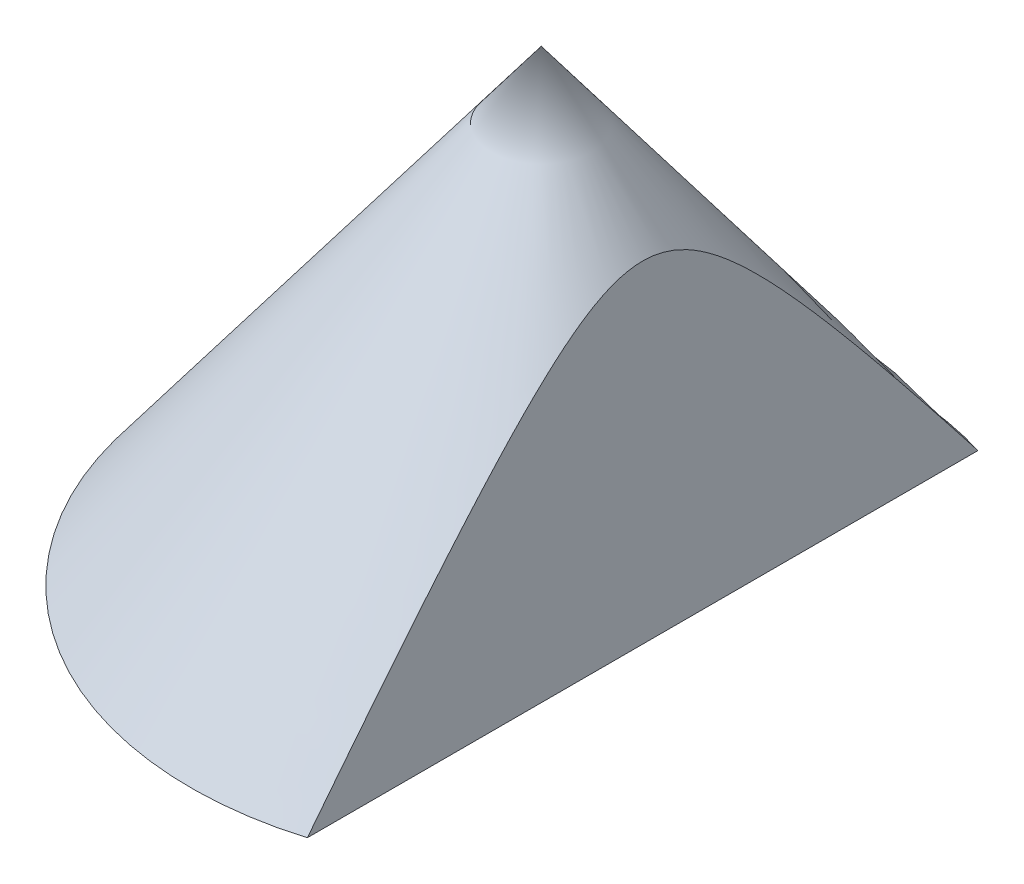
ISO-10303-21;
HEADER;
FILE_DESCRIPTION(('STEP AP214'),'2;1');
FILE_NAME('part.step','',(''),(''),'','','');
FILE_SCHEMA(('AUTOMOTIVE_DESIGN { 1 0 10303 214 1 1 1 1 }'));
ENDSEC;
DATA;
#1=APPLICATION_CONTEXT('core data for automotive mechanical design processes');
#2=APPLICATION_PROTOCOL_DEFINITION('international standard','automotive_design',2000,#1);
#3=PRODUCT_CONTEXT('',#1,'mechanical');
#4=PRODUCT('Part','Part','',(#3));
#5=PRODUCT_RELATED_PRODUCT_CATEGORY('part','',(#4));
#6=PRODUCT_DEFINITION_FORMATION('','',#4);
#7=PRODUCT_DEFINITION_CONTEXT('part definition',#1,'design');
#8=PRODUCT_DEFINITION('design','',#6,#7);
#9=PRODUCT_DEFINITION_SHAPE('','',#8);
#10=(LENGTH_UNIT() NAMED_UNIT(*) SI_UNIT(.MILLI.,.METRE.));
#11=(NAMED_UNIT(*) PLANE_ANGLE_UNIT() SI_UNIT($,.RADIAN.));
#12=(NAMED_UNIT(*) SI_UNIT($,.STERADIAN.) SOLID_ANGLE_UNIT());
#13=UNCERTAINTY_MEASURE_WITH_UNIT(LENGTH_MEASURE(1.E-05),#10,'distance_accuracy_value','');
#14=(GEOMETRIC_REPRESENTATION_CONTEXT(3) GLOBAL_UNCERTAINTY_ASSIGNED_CONTEXT((#13)) GLOBAL_UNIT_ASSIGNED_CONTEXT((#10,
#11,#12)) REPRESENTATION_CONTEXT('',''));
#15=CARTESIAN_POINT('',(0.,0.,0.));
#16=DIRECTION('',(0.,0.,1.));
#17=DIRECTION('',(1.,0.,0.));
#18=AXIS2_PLACEMENT_3D('',#15,#16,#17);
#19=CARTESIAN_POINT('',(0.,12.9310344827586,0.));
#20=DIRECTION('',(0.,-1.,0.));
#21=DIRECTION('',(0.,0.,-1.));
#22=AXIS2_PLACEMENT_3D('',#19,#20,#21);
#23=PLANE('',#22);
#24=DIRECTION('',(0.,0.,1.));
#25=VECTOR('',#24,1.);
#26=CARTESIAN_POINT('',(17.3714648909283,12.9310344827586,-60.));
#27=LINE('',#26,#25);
#28=CARTESIAN_POINT('',(17.3714648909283,12.9310344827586,-57.430237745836));
#29=VERTEX_POINT('',#28);
#30=CARTESIAN_POINT('',(17.3714648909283,12.9310344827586,57.430237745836));
#31=VERTEX_POINT('',#30);
#32=EDGE_CURVE('E70',#29,#31,#27,.T.);
#33=ORIENTED_EDGE('',*,*,#32,.T.);
#34=CARTESIAN_POINT('',(0.,12.9310344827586,0.));
#35=DIRECTION('',(0.,-1.,0.));
#36=DIRECTION('',(0.,0.,-1.));
#37=AXIS2_PLACEMENT_3D('',#34,#35,#36);
#38=CIRCLE('',#37,60.);
#39=EDGE_CURVE('E56',#31,#29,#38,.T.);
#40=ORIENTED_EDGE('',*,*,#39,.T.);
#41=EDGE_LOOP('',(#33,#40));
#42=FACE_BOUND('',#41,.T.);
#43=ADVANCED_FACE('F43',(#42),#23,.T.);
#44=CARTESIAN_POINT('',(0.,12.9310344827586,0.));
#45=DIRECTION('',(0.,-1.,0.));
#46=DIRECTION('',(0.,0.,-1.));
#47=AXIS2_PLACEMENT_3D('',#44,#45,#46);
#48=CONICAL_SURFACE('',#47,60.,0.643501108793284);
#49=CARTESIAN_POINT('',(17.3714648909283,-119.84929793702,-158.636956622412));
#50=CARTESIAN_POINT('',(17.3714648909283,-116.626973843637,-156.205759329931));
#51=CARTESIAN_POINT('',(17.3714648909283,-113.404961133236,-153.774149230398));
#52=CARTESIAN_POINT('',(17.3714648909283,-106.961670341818,-148.909955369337));
#53=CARTESIAN_POINT('',(17.3714648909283,-103.740392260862,-146.477371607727));
#54=CARTESIAN_POINT('',(17.3714648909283,-97.2986116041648,-141.611028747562));
#55=CARTESIAN_POINT('',(17.3714648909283,-94.0781090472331,-139.177269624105));
#56=CARTESIAN_POINT('',(17.3714648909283,-87.6380948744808,-134.308440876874));
#57=CARTESIAN_POINT('',(17.3714648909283,-84.4185832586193,-131.873371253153));
#58=CARTESIAN_POINT('',(17.3714648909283,-77.9775812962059,-126.999309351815));
#59=CARTESIAN_POINT('',(17.3714648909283,-74.7560920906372,-124.56031556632));
#60=CARTESIAN_POINT('',(17.3714648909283,-68.314504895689,-119.680491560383));
#61=CARTESIAN_POINT('',(17.3714648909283,-65.0944069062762,-117.239661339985));
#62=CARTESIAN_POINT('',(17.3714648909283,-58.6559505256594,-112.355846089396));
#63=CARTESIAN_POINT('',(17.3714648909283,-55.437592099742,-109.912861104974));
#64=CARTESIAN_POINT('',(17.3714648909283,-49.0029127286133,-105.024211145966));
#65=CARTESIAN_POINT('',(17.3714648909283,-45.7865917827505,-102.578546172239));
#66=CARTESIAN_POINT('',(17.3714648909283,-39.1696396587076,-97.5417048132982));
#67=CARTESIAN_POINT('',(17.3714648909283,-35.7691587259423,-94.9503310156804));
#68=CARTESIAN_POINT('',(17.3714648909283,-28.9717723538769,-89.7628984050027));
#69=CARTESIAN_POINT('',(17.3714648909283,-25.5748669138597,-87.1668395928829));
#70=CARTESIAN_POINT('',(17.3714648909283,-18.7854778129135,-81.9684796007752));
#71=CARTESIAN_POINT('',(17.3714648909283,-15.3929944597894,-79.366178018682));
#72=CARTESIAN_POINT('',(17.3714648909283,-8.61421933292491,-74.1535487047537));
#73=CARTESIAN_POINT('',(17.3714648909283,-5.22792753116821,-71.5432210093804));
#74=CARTESIAN_POINT('',(17.3714648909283,-0.156104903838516,-67.6203896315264));
#75=CARTESIAN_POINT('',(17.3714648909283,1.53262868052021,-66.3120267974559));
#76=CARTESIAN_POINT('',(17.3714648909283,4.90754408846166,-63.6920146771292));
#77=CARTESIAN_POINT('',(17.3714648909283,6.59372591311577,-62.3803653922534));
#78=CARTESIAN_POINT('',(17.3714648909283,9.96305894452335,-59.7531103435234));
#79=CARTESIAN_POINT('',(17.3714648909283,11.646210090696,-58.437504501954));
#80=CARTESIAN_POINT('',(17.3714648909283,15.0087779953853,-55.8015301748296));
#81=CARTESIAN_POINT('',(17.3714648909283,16.6881947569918,-54.4811616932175));
#82=CARTESIAN_POINT('',(17.3714648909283,20.042222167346,-51.8347320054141));
#83=CARTESIAN_POINT('',(17.3714648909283,21.7168333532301,-50.5086714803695));
#84=CARTESIAN_POINT('',(17.3714648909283,25.0602681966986,-47.8492573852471));
#85=CARTESIAN_POINT('',(17.3714648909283,26.7290918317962,-46.5159037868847));
#86=CARTESIAN_POINT('',(17.3714648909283,30.0592713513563,-43.8400087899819));
#87=CARTESIAN_POINT('',(17.3714648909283,31.7206274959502,-42.4974677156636));
#88=CARTESIAN_POINT('',(17.3714648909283,34.2053333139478,-40.474668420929));
#89=CARTESIAN_POINT('',(17.3714648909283,35.032344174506,-39.7989065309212));
#90=CARTESIAN_POINT('',(17.3714648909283,36.6835274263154,-38.4439248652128));
#91=CARTESIAN_POINT('',(17.3714648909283,37.5076998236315,-37.7647050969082));
#92=CARTESIAN_POINT('',(17.3714648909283,38.860030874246,-36.6446872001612));
#93=CARTESIAN_POINT('',(17.3714648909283,39.389158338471,-36.2050586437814));
#94=CARTESIAN_POINT('',(17.3714648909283,40.4458870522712,-35.3239690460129));
#95=CARTESIAN_POINT('',(17.3714648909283,40.9734882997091,-34.8825080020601));
#96=CARTESIAN_POINT('',(17.3714648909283,42.0270005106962,-33.9975523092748));
#97=CARTESIAN_POINT('',(17.3714648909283,42.5529114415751,-33.5540576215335));
#98=CARTESIAN_POINT('',(17.3714648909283,43.6028270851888,-32.6648182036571));
#99=CARTESIAN_POINT('',(17.3714648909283,44.1268317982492,-32.2190734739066));
#100=CARTESIAN_POINT('',(17.3714648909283,45.6965104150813,-30.8773508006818));
#101=CARTESIAN_POINT('',(17.3714648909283,46.7389781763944,-29.9776142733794));
#102=CARTESIAN_POINT('',(17.3714648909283,48.812939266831,-28.1656207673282));
#103=CARTESIAN_POINT('',(17.3714648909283,49.8444329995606,-27.2533642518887));
#104=CARTESIAN_POINT('',(17.3714648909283,51.3777363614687,-25.8756806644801));
#105=CARTESIAN_POINT('',(17.3714648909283,51.8849929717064,-25.4163139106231));
#106=CARTESIAN_POINT('',(17.3714648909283,52.8953462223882,-24.4930310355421));
#107=CARTESIAN_POINT('',(17.3714648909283,53.3984428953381,-24.0291149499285));
#108=CARTESIAN_POINT('',(17.3714648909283,54.3998747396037,-23.0959876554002));
#109=CARTESIAN_POINT('',(17.3714648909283,54.898209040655,-22.6267755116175));
#110=CARTESIAN_POINT('',(17.3714648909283,55.8891522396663,-21.6823424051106));
#111=CARTESIAN_POINT('',(17.3714648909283,56.3817611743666,-21.2071214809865));
#112=CARTESIAN_POINT('',(17.3714648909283,57.359552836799,-20.250304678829));
#113=CARTESIAN_POINT('',(17.3714648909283,57.844744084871,-19.7687175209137));
#114=CARTESIAN_POINT('',(17.3714648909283,58.8069593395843,-18.7974055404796));
#115=CARTESIAN_POINT('',(17.3714648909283,59.2839830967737,-18.3076804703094));
#116=CARTESIAN_POINT('',(17.3714648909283,60.2278915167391,-17.3188509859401));
#117=CARTESIAN_POINT('',(17.3714648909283,60.6947795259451,-16.8197497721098));
#118=CARTESIAN_POINT('',(17.3714648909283,61.6162051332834,-15.8103016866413));
#119=CARTESIAN_POINT('',(17.3714648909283,62.0707438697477,-15.2999558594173));
#120=CARTESIAN_POINT('',(17.3714648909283,62.7324496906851,-14.5341796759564));
#121=CARTESIAN_POINT('',(17.3714648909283,62.945583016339,-14.2838966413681));
#122=CARTESIAN_POINT('',(17.3714648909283,63.3678121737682,-13.7799393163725));
#123=CARTESIAN_POINT('',(17.3714648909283,63.5769079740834,-13.5262649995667));
#124=CARTESIAN_POINT('',(17.3714648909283,63.9905886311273,-13.0151834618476));
#125=CARTESIAN_POINT('',(17.3714648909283,64.1951726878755,-12.7577755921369));
#126=CARTESIAN_POINT('',(17.3714648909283,64.5991806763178,-12.2389476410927));
#127=CARTESIAN_POINT('',(17.3714648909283,64.7986046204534,-11.9775275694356));
#128=CARTESIAN_POINT('',(17.3714648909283,65.3882628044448,-11.1865420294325));
#129=CARTESIAN_POINT('',(17.3714648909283,65.7697655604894,-10.6503955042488));
#130=CARTESIAN_POINT('',(17.3714648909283,66.5023201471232,-9.55764440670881));
#131=CARTESIAN_POINT('',(17.3714648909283,66.8533790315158,-9.0010446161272));
#132=CARTESIAN_POINT('',(17.3714648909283,67.4316320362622,-8.00789999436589));
#133=CARTESIAN_POINT('',(17.3714648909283,67.6677119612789,-7.57655165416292));
#134=CARTESIAN_POINT('',(17.3714648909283,68.1121122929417,-6.69961379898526));
#135=CARTESIAN_POINT('',(17.3714648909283,68.3204312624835,-6.25402354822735));
#136=CARTESIAN_POINT('',(17.3714648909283,68.7024948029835,-5.34936555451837));
#137=CARTESIAN_POINT('',(17.3714648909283,68.8763208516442,-4.89033258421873));
#138=CARTESIAN_POINT('',(17.3714648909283,69.1828836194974,-3.95869975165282));
#139=CARTESIAN_POINT('',(17.3714648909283,69.3156364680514,-3.48610529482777));
#140=CARTESIAN_POINT('',(17.3714648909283,69.5089446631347,-2.63641343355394));
#141=CARTESIAN_POINT('',(17.3714648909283,69.5789930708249,-2.26147493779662));
#142=CARTESIAN_POINT('',(17.3714648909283,69.6874574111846,-1.50703139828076));
#143=CARTESIAN_POINT('',(17.3714648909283,69.725877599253,-1.1275269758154));
#144=CARTESIAN_POINT('',(17.3714648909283,69.7694552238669,-0.366822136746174));
#145=CARTESIAN_POINT('',(17.3714648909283,69.7746324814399,0.0143771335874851));
#146=CARTESIAN_POINT('',(17.3714648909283,69.7515516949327,0.775767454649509));
#147=CARTESIAN_POINT('',(17.3714648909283,69.7232922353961,1.15595846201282));
#148=CARTESIAN_POINT('',(17.3714648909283,69.6347197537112,1.9110753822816));
#149=CARTESIAN_POINT('',(17.3714648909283,69.5745291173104,2.2860158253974));
#150=CARTESIAN_POINT('',(17.3714648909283,69.4245281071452,3.02986902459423));
#151=CARTESIAN_POINT('',(17.3714648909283,69.3347170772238,3.39878164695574));
#152=CARTESIAN_POINT('',(17.3714648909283,69.1284406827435,4.1293835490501));
#153=CARTESIAN_POINT('',(17.3714648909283,69.0119501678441,4.49106566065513));
#154=CARTESIAN_POINT('',(17.3714648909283,68.7556718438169,5.20604645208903));
#155=CARTESIAN_POINT('',(17.3714648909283,68.6158820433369,5.55934441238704));
#156=CARTESIAN_POINT('',(17.3714648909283,68.3194332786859,6.24983383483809));
#157=CARTESIAN_POINT('',(17.3714648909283,68.1631969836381,6.58720807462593));
#158=CARTESIAN_POINT('',(17.3714648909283,67.8342436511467,7.25383530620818));
#159=CARTESIAN_POINT('',(17.3714648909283,67.6615244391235,7.58308721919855));
#160=CARTESIAN_POINT('',(17.3714648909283,67.3018783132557,8.23408952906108));
#161=CARTESIAN_POINT('',(17.3714648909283,67.1149387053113,8.55583288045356));
#162=CARTESIAN_POINT('',(17.3714648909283,66.7290807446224,9.19198135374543));
#163=CARTESIAN_POINT('',(17.3714648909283,66.5301636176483,9.50638722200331));
#164=CARTESIAN_POINT('',(17.3714648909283,66.1210809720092,10.1299753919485));
#165=CARTESIAN_POINT('',(17.3714648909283,65.910865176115,10.4391246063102));
#166=CARTESIAN_POINT('',(17.3714648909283,65.481561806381,11.0511906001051));
#167=CARTESIAN_POINT('',(17.3714648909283,65.2624740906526,11.3541072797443));
#168=CARTESIAN_POINT('',(17.3714648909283,64.8167914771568,11.9540882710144));
#169=CARTESIAN_POINT('',(17.3714648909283,64.5902008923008,12.2511557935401));
#170=CARTESIAN_POINT('',(17.3714648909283,64.1304333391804,12.840119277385));
#171=CARTESIAN_POINT('',(17.3714648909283,63.8972566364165,13.1320154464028));
#172=CARTESIAN_POINT('',(17.3714648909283,63.3798299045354,13.7667460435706));
#173=CARTESIAN_POINT('',(17.3714648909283,63.0943725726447,14.1085954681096));
#174=CARTESIAN_POINT('',(17.3714648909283,62.5165068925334,14.7863800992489));
#175=CARTESIAN_POINT('',(17.3714648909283,62.2240982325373,15.1223150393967));
#176=CARTESIAN_POINT('',(17.3714648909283,61.6332669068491,15.7889601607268));
#177=CARTESIAN_POINT('',(17.3714648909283,61.3348431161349,16.1196693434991));
#178=CARTESIAN_POINT('',(17.3714648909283,60.7328341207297,16.7763610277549));
#179=CARTESIAN_POINT('',(17.3714648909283,60.4292487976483,17.102343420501));
#180=CARTESIAN_POINT('',(17.3714648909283,59.5112980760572,18.0744710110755));
#181=CARTESIAN_POINT('',(17.3714648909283,58.8902071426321,18.714271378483));
#182=CARTESIAN_POINT('',(17.3714648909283,57.6343408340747,19.9801142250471));
#183=CARTESIAN_POINT('',(17.3714648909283,56.9995666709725,20.6061579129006));
#184=CARTESIAN_POINT('',(17.3714648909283,55.7173675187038,21.8487873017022));
#185=CARTESIAN_POINT('',(17.3714648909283,55.0699118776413,22.4653413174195));
#186=CARTESIAN_POINT('',(17.3714648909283,53.766252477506,23.6891351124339));
#187=CARTESIAN_POINT('',(17.3714648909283,53.1100485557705,24.2963747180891));
#188=CARTESIAN_POINT('',(17.3714648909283,51.790824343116,25.5027835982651));
#189=CARTESIAN_POINT('',(17.3714648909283,51.1278073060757,26.1019564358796));
#190=CARTESIAN_POINT('',(17.3714648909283,49.795904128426,27.2937260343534));
#191=CARTESIAN_POINT('',(17.3714648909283,49.1270180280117,27.8863228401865));
#192=CARTESIAN_POINT('',(17.3714648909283,47.7820136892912,29.0679608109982));
#193=CARTESIAN_POINT('',(17.3714648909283,47.1058784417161,29.6569825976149));
#194=CARTESIAN_POINT('',(17.3714648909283,45.7494307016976,30.8301945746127));
#195=CARTESIAN_POINT('',(17.3714648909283,45.0691182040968,31.4143847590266));
#196=CARTESIAN_POINT('',(17.3714648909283,43.7048624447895,32.5786487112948));
#197=CARTESIAN_POINT('',(17.3714648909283,43.0209188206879,33.1587220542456));
#198=CARTESIAN_POINT('',(17.3714648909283,41.6499670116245,34.3152364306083));
#199=CARTESIAN_POINT('',(17.3714648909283,40.962958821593,34.8916774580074));
#200=CARTESIAN_POINT('',(17.3714648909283,39.5875148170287,36.040354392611));
#201=CARTESIAN_POINT('',(17.3714648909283,38.8990837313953,36.6125959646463));
#202=CARTESIAN_POINT('',(17.3714648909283,37.5199125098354,37.754288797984));
#203=CARTESIAN_POINT('',(17.3714648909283,36.8291723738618,38.3237400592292));
#204=CARTESIAN_POINT('',(17.3714648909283,35.445691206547,39.4601514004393));
#205=CARTESIAN_POINT('',(17.3714648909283,34.7529502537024,40.0271115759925));
#206=CARTESIAN_POINT('',(17.3714648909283,33.3656765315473,41.1588342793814));
#207=CARTESIAN_POINT('',(17.3714648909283,32.6711437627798,41.7235968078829));
#208=CARTESIAN_POINT('',(17.3714648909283,30.6018125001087,43.4014515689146));
#209=CARTESIAN_POINT('',(17.3714648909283,29.2247093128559,44.5117020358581));
#210=CARTESIAN_POINT('',(17.3714648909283,26.4655448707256,46.7260278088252));
#211=CARTESIAN_POINT('',(17.3714648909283,25.0834836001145,47.8301030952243));
#212=CARTESIAN_POINT('',(17.3714648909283,22.3153067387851,50.0331870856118));
#213=CARTESIAN_POINT('',(17.3714648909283,20.9291911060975,51.132195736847));
#214=CARTESIAN_POINT('',(17.3714648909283,18.1536227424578,53.3259923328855));
#215=CARTESIAN_POINT('',(17.3714648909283,16.764170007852,54.4207802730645));
#216=CARTESIAN_POINT('',(17.3714648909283,13.9824040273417,56.6068661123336));
#217=CARTESIAN_POINT('',(17.3714648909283,12.590090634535,57.6981638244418));
#218=CARTESIAN_POINT('',(17.3714648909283,9.80310632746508,59.8777452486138));
#219=CARTESIAN_POINT('',(17.3714648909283,8.40843541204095,60.9660289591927));
#220=CARTESIAN_POINT('',(17.3714648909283,4.22144349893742,64.2270171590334));
#221=CARTESIAN_POINT('',(17.3714648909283,1.42612499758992,66.395873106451));
#222=CARTESIAN_POINT('',(17.3714648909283,-4.17255326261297,70.7275540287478));
#223=CARTESIAN_POINT('',(17.3714648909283,-6.97591750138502,72.8903732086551));
#224=CARTESIAN_POINT('',(17.3714648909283,-12.5872016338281,77.2100998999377));
#225=CARTESIAN_POINT('',(17.3714648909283,-15.3951215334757,79.3670074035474));
#226=CARTESIAN_POINT('',(17.3714648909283,-21.0144436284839,83.676118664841));
#227=CARTESIAN_POINT('',(17.3714648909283,-23.8258457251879,85.8283225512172));
#228=CARTESIAN_POINT('',(17.3714648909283,-29.4514903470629,90.1290154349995));
#229=CARTESIAN_POINT('',(17.3714648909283,-32.2657328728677,92.2775044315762));
#230=CARTESIAN_POINT('',(17.3714648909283,-37.8876161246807,96.5646766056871));
#231=CARTESIAN_POINT('',(17.3714648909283,-40.6952495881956,98.7033693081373));
#232=CARTESIAN_POINT('',(17.3714648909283,-46.3123993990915,102.978280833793));
#233=CARTESIAN_POINT('',(17.3714648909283,-49.12191574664,105.114499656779));
#234=CARTESIAN_POINT('',(17.3714648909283,-57.5528363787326,111.520113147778));
#235=CARTESIAN_POINT('',(17.3714648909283,-63.1765744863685,115.786436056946));
#236=CARTESIAN_POINT('',(17.3714648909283,-74.4273826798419,124.312409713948));
#237=CARTESIAN_POINT('',(17.3714648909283,-80.054451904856,128.572061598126));
#238=CARTESIAN_POINT('',(17.3714648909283,-91.3118649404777,137.087017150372));
#239=CARTESIAN_POINT('',(17.3714648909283,-96.9422087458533,141.342320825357));
#240=CARTESIAN_POINT('',(17.3714648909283,-104.012669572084,146.682774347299));
#241=CARTESIAN_POINT('',(17.3714648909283,-105.451618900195,147.769470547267));
#242=CARTESIAN_POINT('',(17.3714648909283,-108.329699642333,149.942680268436));
#243=CARTESIAN_POINT('',(17.3714648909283,-109.768831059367,151.029193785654));
#244=CARTESIAN_POINT('',(17.3714648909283,-112.648120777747,153.202696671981));
#245=CARTESIAN_POINT('',(17.3714648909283,-114.088279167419,154.289685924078));
#246=CARTESIAN_POINT('',(17.3714648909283,-116.968703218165,156.463463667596));
#247=CARTESIAN_POINT('',(17.3714648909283,-118.408968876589,157.55025216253));
#248=CARTESIAN_POINT('',(17.3714648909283,-119.84929793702,158.636956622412));
#249=B_SPLINE_CURVE_WITH_KNOTS('',3,(#49,#50,#51,#52,#53,#54,#55,#56,#57,#58,#59,#60,#61,#62,
#63,#64,#65,#66,#67,#68,#69,#70,#71,#72,#73,#74,#75,#76,#77,#78,#79,#80,#81,#82,#83,#84,#85,#86,
#87,#88,#89,#90,#91,#92,#93,#94,#95,#96,#97,#98,#99,#100,#101,#102,#103,#104,#105,#106,#107,
#108,#109,#110,#111,#112,#113,#114,#115,#116,#117,#118,#119,#120,#121,#122,#123,#124,#125,#126,
#127,#128,#129,#130,#131,#132,#133,#134,#135,#136,#137,#138,#139,#140,#141,#142,#143,#144,#145,
#146,#147,#148,#149,#150,#151,#152,#153,#154,#155,#156,#157,#158,#159,#160,#161,#162,#163,#164,
#165,#166,#167,#168,#169,#170,#171,#172,#173,#174,#175,#176,#177,#178,#179,#180,#181,#182,#183,
#184,#185,#186,#187,#188,#189,#190,#191,#192,#193,#194,#195,#196,#197,#198,#199,#200,#201,#202,
#203,#204,#205,#206,#207,#208,#209,#210,#211,#212,#213,#214,#215,#216,#217,#218,#219,#220,#221,
#222,#223,#224,#225,#226,#227,#228,#229,#230,#231,#232,#233,#234,#235,#236,#237,#238,#239,#240,
#241,#242,#243,#244,#245,#246,#247,#248),.UNSPECIFIED.,.F.,.F.,(4,2,2,2,2,2,2,2,2,2,2,2,2,2,2,2,
2,2,2,2,2,2,2,2,2,2,2,2,2,2,2,2,2,2,2,2,2,2,2,2,2,2,2,2,2,2,2,2,2,2,2,2,2,2,2,2,2,2,2,2,2,2,2,2,
2,2,2,2,2,2,2,2,2,2,2,2,2,2,2,2,2,2,2,2,2,2,2,2,2,2,2,2,2,2,2,2,2,2,2,4),(0.,12.1097826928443,
24.2195663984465,36.3296190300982,48.4396711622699,60.5615578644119,72.6834442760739,
84.8050791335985,96.9267101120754,109.752711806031,122.578710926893,135.405559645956,
148.232350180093,154.64114642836,161.049939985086,167.458860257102,173.86777522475,
180.275943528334,186.68413670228,193.092104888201,196.296065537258,199.500019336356,
201.563809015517,203.627601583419,205.691433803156,207.755265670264,211.886337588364,
216.017257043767,218.070267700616,220.123262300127,222.176625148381,224.229974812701,
226.280755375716,228.33159846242,230.381753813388,232.431719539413,233.417893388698,
234.404074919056,235.390429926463,236.376782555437,238.350046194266,240.3228514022,
241.797233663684,243.271692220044,244.742625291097,246.212979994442,247.35604477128,
248.498955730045,249.641185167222,250.78346295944,251.921393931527,253.059350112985,
254.198383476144,255.337514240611,256.4523847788,257.567402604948,258.683427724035,
259.799338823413,260.920710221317,262.042099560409,263.162855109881,264.283565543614,
265.61953828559,266.955571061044,268.291856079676,269.628171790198,272.30291532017,
274.977422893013,277.659479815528,280.341586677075,283.022467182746,285.70332934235,
288.393460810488,291.083595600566,293.774004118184,296.46441708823,299.150033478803,
301.835649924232,304.521162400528,307.206674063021,312.513401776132,317.820146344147,
323.126946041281,328.43375155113,333.740836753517,339.047924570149,349.662030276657,
360.284155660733,370.906294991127,381.528139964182,392.149987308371,402.738248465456,
413.326510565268,434.50317721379,455.675724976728,476.848239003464,482.257800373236,
487.667467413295,493.080453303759,498.493333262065),.UNSPECIFIED.);
#250=EDGE_CURVE('E11',#29,#31,#249,.T.);
#251=ORIENTED_EDGE('',*,*,#250,.F.);
#252=ORIENTED_EDGE('',*,*,#39,.F.);
#253=EDGE_LOOP('',(#251,#252));
#254=FACE_BOUND('',#253,.T.);
#255=CARTESIAN_POINT('',(0.,92.9310344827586,0.));
#256=VERTEX_POINT('',#255);
#257=VERTEX_LOOP('',#256);
#258=FACE_BOUND('',#257,.T.);
#259=ADVANCED_FACE('F68',(#254,#258),#48,.T.);
#260=CARTESIAN_POINT('',(17.3714648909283,69.7690812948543,-60.));
#261=DIRECTION('',(-1.,0.,0.));
#262=DIRECTION('',(0.,-1.,0.));
#263=AXIS2_PLACEMENT_3D('',#260,#261,#262);
#264=PLANE('',#263);
#265=ORIENTED_EDGE('',*,*,#32,.F.);
#266=ORIENTED_EDGE('',*,*,#250,.T.);
#267=EDGE_LOOP('',(#265,#266));
#268=FACE_BOUND('',#267,.T.);
#269=ADVANCED_FACE('F71',(#268),#264,.F.);
#270=CLOSED_SHELL('',(#43,#259,#269));
#271=MANIFOLD_SOLID_BREP('B2',#270);
#272=ADVANCED_BREP_SHAPE_REPRESENTATION('',(#18,#271),#14);
#273=SHAPE_DEFINITION_REPRESENTATION(#9,#272);
ENDSEC;
END-ISO-10303-21;
